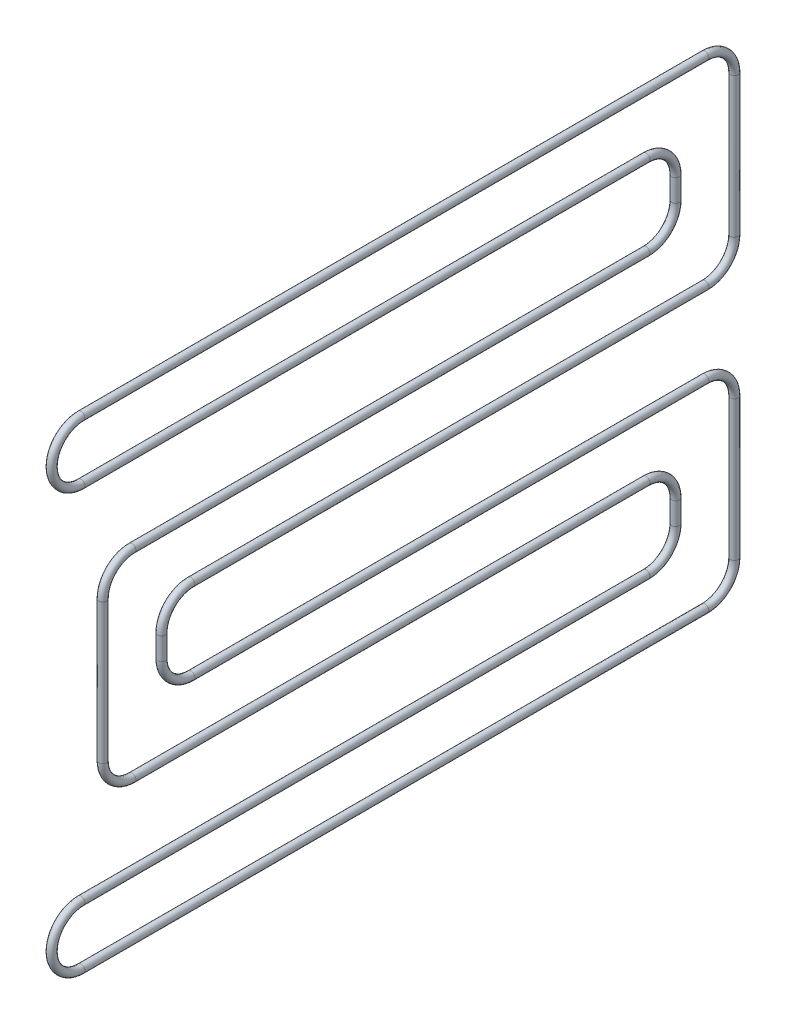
ISO-10303-21;
HEADER;
FILE_DESCRIPTION(('STEP AP214'),'2;1');
FILE_NAME('part.step','',(''),(''),'','','');
FILE_SCHEMA(('AUTOMOTIVE_DESIGN { 1 0 10303 214 1 1 1 1 }'));
ENDSEC;
DATA;
#1=APPLICATION_CONTEXT('core data for automotive mechanical design processes');
#2=APPLICATION_PROTOCOL_DEFINITION('international standard','automotive_design',2000,#1);
#3=PRODUCT_CONTEXT('',#1,'mechanical');
#4=PRODUCT('Part','Part','',(#3));
#5=PRODUCT_RELATED_PRODUCT_CATEGORY('part','',(#4));
#6=PRODUCT_DEFINITION_FORMATION('','',#4);
#7=PRODUCT_DEFINITION_CONTEXT('part definition',#1,'design');
#8=PRODUCT_DEFINITION('design','',#6,#7);
#9=PRODUCT_DEFINITION_SHAPE('','',#8);
#10=(LENGTH_UNIT() NAMED_UNIT(*) SI_UNIT(.MILLI.,.METRE.));
#11=(NAMED_UNIT(*) PLANE_ANGLE_UNIT() SI_UNIT($,.RADIAN.));
#12=(NAMED_UNIT(*) SI_UNIT($,.STERADIAN.) SOLID_ANGLE_UNIT());
#13=UNCERTAINTY_MEASURE_WITH_UNIT(LENGTH_MEASURE(1.E-05),#10,'distance_accuracy_value','');
#14=(GEOMETRIC_REPRESENTATION_CONTEXT(3) GLOBAL_UNCERTAINTY_ASSIGNED_CONTEXT((#13)) GLOBAL_UNIT_ASSIGNED_CONTEXT((#10,
#11,#12)) REPRESENTATION_CONTEXT('',''));
#15=CARTESIAN_POINT('',(0.,0.,0.));
#16=DIRECTION('',(0.,0.,1.));
#17=DIRECTION('',(1.,0.,0.));
#18=AXIS2_PLACEMENT_3D('',#15,#16,#17);
#19=CARTESIAN_POINT('',(0.,0.,318.));
#20=DIRECTION('',(0.,0.,-1.));
#21=DIRECTION('',(0.,1.,0.));
#22=AXIS2_PLACEMENT_3D('',#19,#20,#21);
#23=CYLINDRICAL_SURFACE('',#22,2.);
#24=CARTESIAN_POINT('',(0.,0.,318.));
#25=DIRECTION('',(0.,0.,1.));
#26=DIRECTION('',(1.,0.,0.));
#27=AXIS2_PLACEMENT_3D('',#24,#25,#26);
#28=CIRCLE('',#27,2.);
#29=CARTESIAN_POINT('',(0.,2.00000000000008,318.));
#30=VERTEX_POINT('',#29);
#31=EDGE_CURVE('E46',#30,#30,#28,.T.);
#32=ORIENTED_EDGE('',*,*,#31,.F.);
#33=EDGE_LOOP('',(#32));
#34=FACE_BOUND('',#33,.T.);
#35=CARTESIAN_POINT('',(0.,0.,2.22044604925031E-13));
#36=DIRECTION('',(0.,0.,1.));
#37=DIRECTION('',(1.,0.,0.));
#38=AXIS2_PLACEMENT_3D('',#35,#36,#37);
#39=CIRCLE('',#38,2.);
#40=CARTESIAN_POINT('',(2.,0.,1.11022302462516E-13));
#41=VERTEX_POINT('',#40);
#42=EDGE_CURVE('E10',#41,#41,#39,.T.);
#43=ORIENTED_EDGE('',*,*,#42,.T.);
#44=EDGE_LOOP('',(#43));
#45=FACE_BOUND('',#44,.T.);
#46=ADVANCED_FACE('F35',(#34,#45),#23,.T.);
#47=CARTESIAN_POINT('',(0.,-15.,318.));
#48=DIRECTION('',(-1.,0.,0.));
#49=DIRECTION('',(0.,0.,1.));
#50=AXIS2_PLACEMENT_3D('',#47,#48,#49);
#51=TOROIDAL_SURFACE('',#50,15.,2.);
#52=CARTESIAN_POINT('',(0.,-30.,318.));
#53=DIRECTION('',(0.,0.,-1.));
#54=DIRECTION('',(1.,0.,0.));
#55=AXIS2_PLACEMENT_3D('',#52,#53,#54);
#56=CIRCLE('',#55,2.);
#57=CARTESIAN_POINT('',(0.,-32.,318.));
#58=VERTEX_POINT('',#57);
#59=EDGE_CURVE('E53',#58,#58,#56,.T.);
#60=CARTESIAN_POINT('',(0.,-15.,318.));
#61=DIRECTION('',(-1.,0.,0.));
#62=DIRECTION('',(0.,0.,1.));
#63=AXIS2_PLACEMENT_3D('',#60,#61,#62);
#64=CIRCLE('',#63,17.);
#65=EDGE_CURVE('',#58,#30,#64,.T.);
#66=ORIENTED_EDGE('',*,*,#59,.F.);
#67=ORIENTED_EDGE('',*,*,#31,.T.);
#68=ORIENTED_EDGE('',*,*,#65,.T.);
#69=ORIENTED_EDGE('',*,*,#65,.F.);
#70=EDGE_LOOP('',(#66,#68,#67,#69));
#71=FACE_BOUND('',#70,.T.);
#72=ADVANCED_FACE('F83',(#71),#51,.T.);
#73=CARTESIAN_POINT('',(0.,-30.0000000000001,30.0000000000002));
#74=DIRECTION('',(0.,0.,1.));
#75=DIRECTION('',(0.,-1.,0.));
#76=AXIS2_PLACEMENT_3D('',#73,#74,#75);
#77=CYLINDRICAL_SURFACE('',#76,2.);
#78=CARTESIAN_POINT('',(0.,-30.0000000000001,30.0000000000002));
#79=DIRECTION('',(0.,0.,-1.));
#80=DIRECTION('',(1.,0.,0.));
#81=AXIS2_PLACEMENT_3D('',#78,#79,#80);
#82=CIRCLE('',#81,2.);
#83=CARTESIAN_POINT('',(0.,-28.0000000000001,30.0000000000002));
#84=VERTEX_POINT('',#83);
#85=EDGE_CURVE('E58',#84,#84,#82,.T.);
#86=ORIENTED_EDGE('',*,*,#85,.F.);
#87=EDGE_LOOP('',(#86));
#88=FACE_BOUND('',#87,.T.);
#89=ORIENTED_EDGE('',*,*,#59,.T.);
#90=EDGE_LOOP('',(#89));
#91=FACE_BOUND('',#90,.T.);
#92=ADVANCED_FACE('F88',(#88,#91),#77,.T.);
#93=CARTESIAN_POINT('',(0.,-45.,30.0000000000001));
#94=DIRECTION('',(1.,0.,0.));
#95=DIRECTION('',(0.,0.,-1.));
#96=AXIS2_PLACEMENT_3D('',#93,#94,#95);
#97=TOROIDAL_SURFACE('',#96,14.9999999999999,2.);
#98=CARTESIAN_POINT('',(0.,-45.,15.0000000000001));
#99=DIRECTION('',(0.,-1.,0.));
#100=DIRECTION('',(1.,0.,0.));
#101=AXIS2_PLACEMENT_3D('',#98,#99,#100);
#102=CIRCLE('',#101,2.);
#103=CARTESIAN_POINT('',(0.,-45.,13.0000000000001));
#104=VERTEX_POINT('',#103);
#105=EDGE_CURVE('E283',#104,#104,#102,.T.);
#106=CARTESIAN_POINT('',(0.,-45.,30.0000000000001));
#107=DIRECTION('',(1.,0.,0.));
#108=DIRECTION('',(0.,0.,-1.));
#109=AXIS2_PLACEMENT_3D('',#106,#107,#108);
#110=CIRCLE('',#109,16.9999999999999);
#111=EDGE_CURVE('',#104,#84,#110,.T.);
#112=ORIENTED_EDGE('',*,*,#105,.F.);
#113=ORIENTED_EDGE('',*,*,#85,.T.);
#114=ORIENTED_EDGE('',*,*,#111,.T.);
#115=ORIENTED_EDGE('',*,*,#111,.F.);
#116=EDGE_LOOP('',(#112,#114,#113,#115));
#117=FACE_BOUND('',#116,.T.);
#118=ADVANCED_FACE('F93',(#117),#97,.T.);
#119=CARTESIAN_POINT('',(0.,-56.3332999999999,15.0000000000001));
#120=DIRECTION('',(0.,1.,0.));
#121=DIRECTION('',(0.,0.,1.));
#122=AXIS2_PLACEMENT_3D('',#119,#120,#121);
#123=CYLINDRICAL_SURFACE('',#122,2.);
#124=CARTESIAN_POINT('',(0.,-56.3332999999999,15.0000000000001));
#125=DIRECTION('',(0.,-1.,0.));
#126=DIRECTION('',(1.,0.,0.));
#127=AXIS2_PLACEMENT_3D('',#124,#125,#126);
#128=CIRCLE('',#127,2.);
#129=CARTESIAN_POINT('',(0.,-56.3332999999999,13.0000000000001));
#130=VERTEX_POINT('',#129);
#131=EDGE_CURVE('E279',#130,#130,#128,.T.);
#132=ORIENTED_EDGE('',*,*,#131,.F.);
#133=EDGE_LOOP('',(#132));
#134=FACE_BOUND('',#133,.T.);
#135=ORIENTED_EDGE('',*,*,#105,.T.);
#136=EDGE_LOOP('',(#135));
#137=FACE_BOUND('',#136,.T.);
#138=ADVANCED_FACE('F100',(#134,#137),#123,.T.);
#139=CARTESIAN_POINT('',(0.,-56.3333,30.0000000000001));
#140=DIRECTION('',(1.,0.,0.));
#141=DIRECTION('',(0.,0.,-1.));
#142=AXIS2_PLACEMENT_3D('',#139,#140,#141);
#143=TOROIDAL_SURFACE('',#142,15.,2.);
#144=CARTESIAN_POINT('',(0.,-71.3332999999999,30.));
#145=DIRECTION('',(0.,0.,1.));
#146=DIRECTION('',(1.,0.,0.));
#147=AXIS2_PLACEMENT_3D('',#144,#145,#146);
#148=CIRCLE('',#147,2.);
#149=CARTESIAN_POINT('',(0.,-73.3332999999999,30.));
#150=VERTEX_POINT('',#149);
#151=EDGE_CURVE('E275',#150,#150,#148,.T.);
#152=CARTESIAN_POINT('',(0.,-56.3333,30.0000000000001));
#153=DIRECTION('',(1.,0.,0.));
#154=DIRECTION('',(0.,0.,-1.));
#155=AXIS2_PLACEMENT_3D('',#152,#153,#154);
#156=CIRCLE('',#155,17.);
#157=EDGE_CURVE('',#150,#130,#156,.T.);
#158=ORIENTED_EDGE('',*,*,#151,.F.);
#159=ORIENTED_EDGE('',*,*,#131,.T.);
#160=ORIENTED_EDGE('',*,*,#157,.T.);
#161=ORIENTED_EDGE('',*,*,#157,.F.);
#162=EDGE_LOOP('',(#158,#160,#159,#161));
#163=FACE_BOUND('',#162,.T.);
#164=ADVANCED_FACE('F104',(#163),#143,.T.);
#165=CARTESIAN_POINT('',(0.,-71.3332999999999,292.));
#166=DIRECTION('',(0.,0.,-1.));
#167=DIRECTION('',(-1.,0.,0.));
#168=AXIS2_PLACEMENT_3D('',#165,#166,#167);
#169=CYLINDRICAL_SURFACE('',#168,2.);
#170=CARTESIAN_POINT('',(0.,-71.3332999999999,292.));
#171=DIRECTION('',(0.,0.,1.));
#172=DIRECTION('',(1.,0.,0.));
#173=AXIS2_PLACEMENT_3D('',#170,#171,#172);
#174=CIRCLE('',#173,2.);
#175=CARTESIAN_POINT('',(0.,-69.3333,292.));
#176=VERTEX_POINT('',#175);
#177=EDGE_CURVE('E271',#176,#176,#174,.T.);
#178=ORIENTED_EDGE('',*,*,#177,.F.);
#179=EDGE_LOOP('',(#178));
#180=FACE_BOUND('',#179,.T.);
#181=ORIENTED_EDGE('',*,*,#151,.T.);
#182=EDGE_LOOP('',(#181));
#183=FACE_BOUND('',#182,.T.);
#184=ADVANCED_FACE('F108',(#180,#183),#169,.T.);
#185=CARTESIAN_POINT('',(0.,-86.3333,292.));
#186=DIRECTION('',(-1.,0.,0.));
#187=DIRECTION('',(0.,0.,1.));
#188=AXIS2_PLACEMENT_3D('',#185,#186,#187);
#189=TOROIDAL_SURFACE('',#188,15.,2.);
#190=CARTESIAN_POINT('',(0.,-86.3333,307.));
#191=DIRECTION('',(0.,-1.,0.));
#192=DIRECTION('',(1.,0.,0.));
#193=AXIS2_PLACEMENT_3D('',#190,#191,#192);
#194=CIRCLE('',#193,2.);
#195=CARTESIAN_POINT('',(0.,-86.3333,309.));
#196=VERTEX_POINT('',#195);
#197=EDGE_CURVE('E267',#196,#196,#194,.T.);
#198=CARTESIAN_POINT('',(0.,-86.3333,292.));
#199=DIRECTION('',(-1.,0.,0.));
#200=DIRECTION('',(0.,0.,1.));
#201=AXIS2_PLACEMENT_3D('',#198,#199,#200);
#202=CIRCLE('',#201,17.);
#203=EDGE_CURVE('',#196,#176,#202,.T.);
#204=ORIENTED_EDGE('',*,*,#197,.F.);
#205=ORIENTED_EDGE('',*,*,#177,.T.);
#206=ORIENTED_EDGE('',*,*,#203,.T.);
#207=ORIENTED_EDGE('',*,*,#203,.F.);
#208=EDGE_LOOP('',(#204,#206,#205,#207));
#209=FACE_BOUND('',#208,.T.);
#210=ADVANCED_FACE('F112',(#209),#189,.T.);
#211=CARTESIAN_POINT('',(0.,-157.6666,307.));
#212=DIRECTION('',(0.,1.,0.));
#213=DIRECTION('',(0.,0.,1.));
#214=AXIS2_PLACEMENT_3D('',#211,#212,#213);
#215=CYLINDRICAL_SURFACE('',#214,2.);
#216=CARTESIAN_POINT('',(0.,-157.6666,307.));
#217=DIRECTION('',(0.,-1.,0.));
#218=DIRECTION('',(1.,0.,0.));
#219=AXIS2_PLACEMENT_3D('',#216,#217,#218);
#220=CIRCLE('',#219,2.);
#221=CARTESIAN_POINT('',(0.,-157.6666,309.));
#222=VERTEX_POINT('',#221);
#223=EDGE_CURVE('E263',#222,#222,#220,.T.);
#224=CARTESIAN_POINT('',(0.,-157.6666,309.));
#225=CARTESIAN_POINT('',(0.,-156.923544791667,309.));
#226=CARTESIAN_POINT('',(0.,-156.180489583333,309.));
#227=CARTESIAN_POINT('',(0.,-154.694379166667,309.));
#228=CARTESIAN_POINT('',(0.,-153.951323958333,309.));
#229=CARTESIAN_POINT('',(0.,-152.465213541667,309.));
#230=CARTESIAN_POINT('',(0.,-151.722158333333,309.));
#231=CARTESIAN_POINT('',(0.,-150.236047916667,309.));
#232=CARTESIAN_POINT('',(0.,-149.492992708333,309.));
#233=CARTESIAN_POINT('',(0.,-148.006882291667,309.));
#234=CARTESIAN_POINT('',(0.,-147.263827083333,309.));
#235=CARTESIAN_POINT('',(0.,-145.777716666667,309.));
#236=CARTESIAN_POINT('',(0.,-145.034661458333,309.));
#237=CARTESIAN_POINT('',(0.,-143.548551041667,309.));
#238=CARTESIAN_POINT('',(0.,-142.805495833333,309.));
#239=CARTESIAN_POINT('',(0.,-141.319385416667,309.));
#240=CARTESIAN_POINT('',(0.,-140.576330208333,309.));
#241=CARTESIAN_POINT('',(0.,-139.090219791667,309.));
#242=CARTESIAN_POINT('',(0.,-138.347164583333,309.));
#243=CARTESIAN_POINT('',(0.,-136.861054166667,309.));
#244=CARTESIAN_POINT('',(0.,-136.117998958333,309.));
#245=CARTESIAN_POINT('',(0.,-134.631888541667,309.));
#246=CARTESIAN_POINT('',(0.,-133.888833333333,309.));
#247=CARTESIAN_POINT('',(0.,-132.402722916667,309.));
#248=CARTESIAN_POINT('',(0.,-131.659667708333,309.));
#249=CARTESIAN_POINT('',(0.,-130.173557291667,309.));
#250=CARTESIAN_POINT('',(0.,-129.430502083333,309.));
#251=CARTESIAN_POINT('',(0.,-127.944391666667,309.));
#252=CARTESIAN_POINT('',(0.,-127.201336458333,309.));
#253=CARTESIAN_POINT('',(0.,-125.715226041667,309.));
#254=CARTESIAN_POINT('',(0.,-124.972170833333,309.));
#255=CARTESIAN_POINT('',(0.,-123.486060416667,309.));
#256=CARTESIAN_POINT('',(0.,-122.743005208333,309.));
#257=CARTESIAN_POINT('',(0.,-121.256894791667,309.));
#258=CARTESIAN_POINT('',(0.,-120.513839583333,309.));
#259=CARTESIAN_POINT('',(0.,-119.027729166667,309.));
#260=CARTESIAN_POINT('',(0.,-118.284673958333,309.));
#261=CARTESIAN_POINT('',(0.,-116.798563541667,309.));
#262=CARTESIAN_POINT('',(0.,-116.055508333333,309.));
#263=CARTESIAN_POINT('',(0.,-114.569397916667,309.));
#264=CARTESIAN_POINT('',(0.,-113.826342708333,309.));
#265=CARTESIAN_POINT('',(0.,-112.340232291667,309.));
#266=CARTESIAN_POINT('',(0.,-111.597177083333,309.));
#267=CARTESIAN_POINT('',(0.,-110.111066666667,309.));
#268=CARTESIAN_POINT('',(0.,-109.368011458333,309.));
#269=CARTESIAN_POINT('',(0.,-107.881901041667,309.));
#270=CARTESIAN_POINT('',(0.,-107.138845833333,309.));
#271=CARTESIAN_POINT('',(0.,-105.652735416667,309.));
#272=CARTESIAN_POINT('',(0.,-104.909680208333,309.));
#273=CARTESIAN_POINT('',(0.,-103.423569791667,309.));
#274=CARTESIAN_POINT('',(0.,-102.680514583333,309.));
#275=CARTESIAN_POINT('',(0.,-101.194404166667,309.));
#276=CARTESIAN_POINT('',(0.,-100.451348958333,309.));
#277=CARTESIAN_POINT('',(0.,-98.9652385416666,309.));
#278=CARTESIAN_POINT('',(0.,-98.2221833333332,309.));
#279=CARTESIAN_POINT('',(0.,-96.7360729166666,309.));
#280=CARTESIAN_POINT('',(0.,-95.9930177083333,309.));
#281=CARTESIAN_POINT('',(0.,-94.5069072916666,309.));
#282=CARTESIAN_POINT('',(0.,-93.7638520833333,309.));
#283=CARTESIAN_POINT('',(0.,-92.2777416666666,309.));
#284=CARTESIAN_POINT('',(0.,-91.5346864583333,309.));
#285=CARTESIAN_POINT('',(0.,-90.0485760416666,309.));
#286=CARTESIAN_POINT('',(0.,-89.3055208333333,309.));
#287=CARTESIAN_POINT('',(0.,-87.8194104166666,309.));
#288=CARTESIAN_POINT('',(0.,-87.0763552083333,309.));
#289=CARTESIAN_POINT('',(0.,-86.3332999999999,309.));
#290=B_SPLINE_CURVE_WITH_KNOTS('',3,(#224,#225,#226,#227,#228,#229,#230,#231,#232,#233,#234,
#235,#236,#237,#238,#239,#240,#241,#242,#243,#244,#245,#246,#247,#248,#249,#250,#251,#252,#253,
#254,#255,#256,#257,#258,#259,#260,#261,#262,#263,#264,#265,#266,#267,#268,#269,#270,#271,#272,
#273,#274,#275,#276,#277,#278,#279,#280,#281,#282,#283,#284,#285,#286,#287,#288,#289),
.UNSPECIFIED.,.F.,.F.,(4,2,2,2,2,2,2,2,2,2,2,2,2,2,2,2,2,2,2,2,2,2,2,2,2,2,2,2,2,2,2,2,4),(0.,
2.22916562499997,4.45833124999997,6.68749687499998,8.91666249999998,11.145828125,13.37499375,
15.604159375,17.833325,20.062490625,22.29165625,24.520821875,26.7499875,28.979153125,
31.20831875,33.437484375,35.66665,37.895815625,40.12498125,42.354146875,44.5833125,46.812478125,
49.04164375,51.270809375,53.4999749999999,55.7291406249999,57.9583062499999,60.187471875,
62.4166375,64.6458031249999,66.87496875,69.1041343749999,71.3333),.UNSPECIFIED.);
#291=EDGE_CURVE('BSEAM116',#222,#196,#290,.T.);
#292=ORIENTED_EDGE('',*,*,#223,.F.);
#293=ORIENTED_EDGE('',*,*,#197,.T.);
#294=ORIENTED_EDGE('',*,*,#291,.T.);
#295=ORIENTED_EDGE('',*,*,#291,.F.);
#296=EDGE_LOOP('',(#292,#294,#293,#295));
#297=FACE_BOUND('',#296,.T.);
#298=ADVANCED_FACE('F116',(#297),#215,.T.);
#299=CARTESIAN_POINT('',(0.,-157.6666,292.));
#300=DIRECTION('',(-1.,0.,0.));
#301=DIRECTION('',(0.,0.,1.));
#302=AXIS2_PLACEMENT_3D('',#299,#300,#301);
#303=TOROIDAL_SURFACE('',#302,15.,2.);
#304=CARTESIAN_POINT('',(0.,-172.6666,292.));
#305=DIRECTION('',(0.,0.,-1.));
#306=DIRECTION('',(1.,0.,0.));
#307=AXIS2_PLACEMENT_3D('',#304,#305,#306);
#308=CIRCLE('',#307,2.);
#309=CARTESIAN_POINT('',(0.,-174.6666,292.));
#310=VERTEX_POINT('',#309);
#311=EDGE_CURVE('E259',#310,#310,#308,.T.);
#312=CARTESIAN_POINT('',(0.,-157.6666,292.));
#313=DIRECTION('',(-1.,0.,0.));
#314=DIRECTION('',(0.,0.,1.));
#315=AXIS2_PLACEMENT_3D('',#312,#313,#314);
#316=CIRCLE('',#315,17.);
#317=EDGE_CURVE('',#310,#222,#316,.T.);
#318=ORIENTED_EDGE('',*,*,#311,.F.);
#319=ORIENTED_EDGE('',*,*,#223,.T.);
#320=ORIENTED_EDGE('',*,*,#317,.T.);
#321=ORIENTED_EDGE('',*,*,#317,.F.);
#322=EDGE_LOOP('',(#318,#320,#319,#321));
#323=FACE_BOUND('',#322,.T.);
#324=ADVANCED_FACE('F120',(#323),#303,.T.);
#325=CARTESIAN_POINT('',(0.,-172.6666,30.0000000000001));
#326=DIRECTION('',(0.,0.,1.));
#327=DIRECTION('',(0.,-1.,0.));
#328=AXIS2_PLACEMENT_3D('',#325,#326,#327);
#329=CYLINDRICAL_SURFACE('',#328,2.);
#330=CARTESIAN_POINT('',(0.,-172.6666,30.0000000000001));
#331=DIRECTION('',(0.,0.,-1.));
#332=DIRECTION('',(1.,0.,0.));
#333=AXIS2_PLACEMENT_3D('',#330,#331,#332);
#334=CIRCLE('',#333,2.);
#335=CARTESIAN_POINT('',(0.,-170.6666,30.0000000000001));
#336=VERTEX_POINT('',#335);
#337=EDGE_CURVE('E255',#336,#336,#334,.T.);
#338=ORIENTED_EDGE('',*,*,#337,.F.);
#339=EDGE_LOOP('',(#338));
#340=FACE_BOUND('',#339,.T.);
#341=ORIENTED_EDGE('',*,*,#311,.T.);
#342=EDGE_LOOP('',(#341));
#343=FACE_BOUND('',#342,.T.);
#344=ADVANCED_FACE('F124',(#340,#343),#329,.T.);
#345=CARTESIAN_POINT('',(0.,-187.6666,30.0000000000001));
#346=DIRECTION('',(1.,0.,0.));
#347=DIRECTION('',(0.,0.,-1.));
#348=AXIS2_PLACEMENT_3D('',#345,#346,#347);
#349=TOROIDAL_SURFACE('',#348,15.,2.);
#350=CARTESIAN_POINT('',(0.,-187.6666,15.0000000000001));
#351=DIRECTION('',(0.,-1.,0.));
#352=DIRECTION('',(1.,0.,0.));
#353=AXIS2_PLACEMENT_3D('',#350,#351,#352);
#354=CIRCLE('',#353,2.);
#355=CARTESIAN_POINT('',(0.,-187.6666,13.0000000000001));
#356=VERTEX_POINT('',#355);
#357=EDGE_CURVE('E251',#356,#356,#354,.T.);
#358=CARTESIAN_POINT('',(0.,-187.6666,30.0000000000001));
#359=DIRECTION('',(1.,0.,0.));
#360=DIRECTION('',(0.,0.,-1.));
#361=AXIS2_PLACEMENT_3D('',#358,#359,#360);
#362=CIRCLE('',#361,17.);
#363=EDGE_CURVE('',#356,#336,#362,.T.);
#364=ORIENTED_EDGE('',*,*,#357,.F.);
#365=ORIENTED_EDGE('',*,*,#337,.T.);
#366=ORIENTED_EDGE('',*,*,#363,.T.);
#367=ORIENTED_EDGE('',*,*,#363,.F.);
#368=EDGE_LOOP('',(#364,#366,#365,#367));
#369=FACE_BOUND('',#368,.T.);
#370=ADVANCED_FACE('F128',(#369),#349,.T.);
#371=CARTESIAN_POINT('',(0.,-198.9999,15.0000000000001));
#372=DIRECTION('',(0.,1.,0.));
#373=DIRECTION('',(0.,0.,1.));
#374=AXIS2_PLACEMENT_3D('',#371,#372,#373);
#375=CYLINDRICAL_SURFACE('',#374,2.);
#376=CARTESIAN_POINT('',(0.,-198.9999,15.0000000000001));
#377=DIRECTION('',(0.,-1.,0.));
#378=DIRECTION('',(1.,0.,0.));
#379=AXIS2_PLACEMENT_3D('',#376,#377,#378);
#380=CIRCLE('',#379,2.);
#381=CARTESIAN_POINT('',(0.,-198.9999,13.0000000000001));
#382=VERTEX_POINT('',#381);
#383=EDGE_CURVE('E247',#382,#382,#380,.T.);
#384=ORIENTED_EDGE('',*,*,#383,.F.);
#385=EDGE_LOOP('',(#384));
#386=FACE_BOUND('',#385,.T.);
#387=ORIENTED_EDGE('',*,*,#357,.T.);
#388=EDGE_LOOP('',(#387));
#389=FACE_BOUND('',#388,.T.);
#390=ADVANCED_FACE('F132',(#386,#389),#375,.T.);
#391=CARTESIAN_POINT('',(0.,-198.9999,30.0000000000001));
#392=DIRECTION('',(1.,0.,0.));
#393=DIRECTION('',(0.,0.,-1.));
#394=AXIS2_PLACEMENT_3D('',#391,#392,#393);
#395=TOROIDAL_SURFACE('',#394,15.,2.);
#396=CARTESIAN_POINT('',(0.,-213.9999,30.));
#397=DIRECTION('',(0.,0.,1.));
#398=DIRECTION('',(1.,0.,0.));
#399=AXIS2_PLACEMENT_3D('',#396,#397,#398);
#400=CIRCLE('',#399,2.);
#401=CARTESIAN_POINT('',(0.,-215.9999,30.));
#402=VERTEX_POINT('',#401);
#403=EDGE_CURVE('E243',#402,#402,#400,.T.);
#404=CARTESIAN_POINT('',(0.,-198.9999,30.0000000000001));
#405=DIRECTION('',(1.,0.,0.));
#406=DIRECTION('',(0.,0.,-1.));
#407=AXIS2_PLACEMENT_3D('',#404,#405,#406);
#408=CIRCLE('',#407,17.);
#409=EDGE_CURVE('',#402,#382,#408,.T.);
#410=ORIENTED_EDGE('',*,*,#403,.F.);
#411=ORIENTED_EDGE('',*,*,#383,.T.);
#412=ORIENTED_EDGE('',*,*,#409,.T.);
#413=ORIENTED_EDGE('',*,*,#409,.F.);
#414=EDGE_LOOP('',(#410,#412,#411,#413));
#415=FACE_BOUND('',#414,.T.);
#416=ADVANCED_FACE('F136',(#415),#395,.T.);
#417=CARTESIAN_POINT('',(0.,-213.9999,318.));
#418=DIRECTION('',(0.,0.,-1.));
#419=DIRECTION('',(-1.,0.,0.));
#420=AXIS2_PLACEMENT_3D('',#417,#418,#419);
#421=CYLINDRICAL_SURFACE('',#420,2.);
#422=CARTESIAN_POINT('',(0.,-213.9999,318.));
#423=DIRECTION('',(0.,0.,1.));
#424=DIRECTION('',(1.,0.,0.));
#425=AXIS2_PLACEMENT_3D('',#422,#423,#424);
#426=CIRCLE('',#425,2.);
#427=CARTESIAN_POINT('',(0.,-211.9999,318.));
#428=VERTEX_POINT('',#427);
#429=EDGE_CURVE('E239',#428,#428,#426,.T.);
#430=ORIENTED_EDGE('',*,*,#429,.F.);
#431=EDGE_LOOP('',(#430));
#432=FACE_BOUND('',#431,.T.);
#433=ORIENTED_EDGE('',*,*,#403,.T.);
#434=EDGE_LOOP('',(#433));
#435=FACE_BOUND('',#434,.T.);
#436=ADVANCED_FACE('F140',(#432,#435),#421,.T.);
#437=CARTESIAN_POINT('',(0.,-228.9999,318.));
#438=DIRECTION('',(-1.,0.,0.));
#439=DIRECTION('',(0.,0.,1.));
#440=AXIS2_PLACEMENT_3D('',#437,#438,#439);
#441=TOROIDAL_SURFACE('',#440,15.,2.);
#442=CARTESIAN_POINT('',(0.,-243.9999,318.));
#443=DIRECTION('',(0.,0.,-1.));
#444=DIRECTION('',(1.,0.,0.));
#445=AXIS2_PLACEMENT_3D('',#442,#443,#444);
#446=CIRCLE('',#445,2.);
#447=CARTESIAN_POINT('',(0.,-245.9999,318.));
#448=VERTEX_POINT('',#447);
#449=EDGE_CURVE('E235',#448,#448,#446,.T.);
#450=CARTESIAN_POINT('',(0.,-228.9999,318.));
#451=DIRECTION('',(-1.,0.,0.));
#452=DIRECTION('',(0.,0.,1.));
#453=AXIS2_PLACEMENT_3D('',#450,#451,#452);
#454=CIRCLE('',#453,17.);
#455=EDGE_CURVE('',#448,#428,#454,.T.);
#456=ORIENTED_EDGE('',*,*,#449,.F.);
#457=ORIENTED_EDGE('',*,*,#429,.T.);
#458=ORIENTED_EDGE('',*,*,#455,.T.);
#459=ORIENTED_EDGE('',*,*,#455,.F.);
#460=EDGE_LOOP('',(#456,#458,#457,#459));
#461=FACE_BOUND('',#460,.T.);
#462=ADVANCED_FACE('F144',(#461),#441,.T.);
#463=CARTESIAN_POINT('',(0.,-243.9999,2.4980018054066E-13));
#464=DIRECTION('',(0.,0.,1.));
#465=DIRECTION('',(0.,-1.,0.));
#466=AXIS2_PLACEMENT_3D('',#463,#464,#465);
#467=CYLINDRICAL_SURFACE('',#466,2.);
#468=CARTESIAN_POINT('',(0.,-243.9999,2.4980018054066E-13));
#469=DIRECTION('',(0.,0.,-1.));
#470=DIRECTION('',(1.,0.,0.));
#471=AXIS2_PLACEMENT_3D('',#468,#469,#470);
#472=CIRCLE('',#471,2.);
#473=CARTESIAN_POINT('',(0.,-245.9999,2.7570538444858E-13));
#474=VERTEX_POINT('',#473);
#475=EDGE_CURVE('E231',#474,#474,#472,.T.);
#476=ORIENTED_EDGE('',*,*,#475,.F.);
#477=EDGE_LOOP('',(#476));
#478=FACE_BOUND('',#477,.T.);
#479=ORIENTED_EDGE('',*,*,#449,.T.);
#480=EDGE_LOOP('',(#479));
#481=FACE_BOUND('',#480,.T.);
#482=ADVANCED_FACE('F148',(#478,#481),#467,.T.);
#483=CARTESIAN_POINT('',(0.,-228.9999,0.));
#484=DIRECTION('',(-1.,0.,0.));
#485=DIRECTION('',(0.,0.,1.));
#486=AXIS2_PLACEMENT_3D('',#483,#484,#485);
#487=TOROIDAL_SURFACE('',#486,15.,2.);
#488=CARTESIAN_POINT('',(0.,-228.9999,-15.));
#489=DIRECTION('',(0.,1.,0.));
#490=DIRECTION('',(1.,0.,0.));
#491=AXIS2_PLACEMENT_3D('',#488,#489,#490);
#492=CIRCLE('',#491,2.);
#493=CARTESIAN_POINT('',(0.,-228.9999,-17.));
#494=VERTEX_POINT('',#493);
#495=EDGE_CURVE('E227',#494,#494,#492,.T.);
#496=CARTESIAN_POINT('',(0.,-228.9999,0.));
#497=DIRECTION('',(-1.,0.,0.));
#498=DIRECTION('',(0.,0.,1.));
#499=AXIS2_PLACEMENT_3D('',#496,#497,#498);
#500=CIRCLE('',#499,17.);
#501=EDGE_CURVE('',#494,#474,#500,.T.);
#502=ORIENTED_EDGE('',*,*,#495,.F.);
#503=ORIENTED_EDGE('',*,*,#475,.T.);
#504=ORIENTED_EDGE('',*,*,#501,.T.);
#505=ORIENTED_EDGE('',*,*,#501,.F.);
#506=EDGE_LOOP('',(#502,#504,#503,#505));
#507=FACE_BOUND('',#506,.T.);
#508=ADVANCED_FACE('F152',(#507),#487,.T.);
#509=CARTESIAN_POINT('',(0.,-157.6666,-15.));
#510=DIRECTION('',(0.,-1.,0.));
#511=DIRECTION('',(0.,0.,-1.));
#512=AXIS2_PLACEMENT_3D('',#509,#510,#511);
#513=CYLINDRICAL_SURFACE('',#512,2.);
#514=CARTESIAN_POINT('',(0.,-157.6666,-15.));
#515=DIRECTION('',(0.,1.,0.));
#516=DIRECTION('',(1.,0.,0.));
#517=AXIS2_PLACEMENT_3D('',#514,#515,#516);
#518=CIRCLE('',#517,2.);
#519=CARTESIAN_POINT('',(0.,-157.6666,-17.));
#520=VERTEX_POINT('',#519);
#521=EDGE_CURVE('E223',#520,#520,#518,.T.);
#522=ORIENTED_EDGE('',*,*,#521,.F.);
#523=EDGE_LOOP('',(#522));
#524=FACE_BOUND('',#523,.T.);
#525=ORIENTED_EDGE('',*,*,#495,.T.);
#526=EDGE_LOOP('',(#525));
#527=FACE_BOUND('',#526,.T.);
#528=ADVANCED_FACE('F156',(#524,#527),#513,.T.);
#529=CARTESIAN_POINT('',(0.,-157.6666,0.));
#530=DIRECTION('',(-1.,0.,0.));
#531=DIRECTION('',(0.,0.,1.));
#532=AXIS2_PLACEMENT_3D('',#529,#530,#531);
#533=TOROIDAL_SURFACE('',#532,15.,2.);
#534=CARTESIAN_POINT('',(0.,-142.6666,0.));
#535=DIRECTION('',(0.,0.,1.));
#536=DIRECTION('',(1.,0.,0.));
#537=AXIS2_PLACEMENT_3D('',#534,#535,#536);
#538=CIRCLE('',#537,2.);
#539=CARTESIAN_POINT('',(0.,-140.6666,0.));
#540=VERTEX_POINT('',#539);
#541=EDGE_CURVE('E219',#540,#540,#538,.T.);
#542=CARTESIAN_POINT('',(0.,-157.6666,0.));
#543=DIRECTION('',(-1.,0.,0.));
#544=DIRECTION('',(0.,0.,1.));
#545=AXIS2_PLACEMENT_3D('',#542,#543,#544);
#546=CIRCLE('',#545,17.);
#547=EDGE_CURVE('',#540,#520,#546,.T.);
#548=ORIENTED_EDGE('',*,*,#541,.F.);
#549=ORIENTED_EDGE('',*,*,#521,.T.);
#550=ORIENTED_EDGE('',*,*,#547,.T.);
#551=ORIENTED_EDGE('',*,*,#547,.F.);
#552=EDGE_LOOP('',(#548,#550,#549,#551));
#553=FACE_BOUND('',#552,.T.);
#554=ADVANCED_FACE('F160',(#553),#533,.T.);
#555=CARTESIAN_POINT('',(0.,-142.6666,262.));
#556=DIRECTION('',(0.,0.,-1.));
#557=DIRECTION('',(0.,1.,0.));
#558=AXIS2_PLACEMENT_3D('',#555,#556,#557);
#559=CYLINDRICAL_SURFACE('',#558,2.);
#560=CARTESIAN_POINT('',(0.,-142.6666,262.));
#561=DIRECTION('',(0.,0.,1.));
#562=DIRECTION('',(1.,0.,0.));
#563=AXIS2_PLACEMENT_3D('',#560,#561,#562);
#564=CIRCLE('',#563,2.);
#565=CARTESIAN_POINT('',(0.,-144.6666,262.));
#566=VERTEX_POINT('',#565);
#567=EDGE_CURVE('E215',#566,#566,#564,.T.);
#568=ORIENTED_EDGE('',*,*,#567,.F.);
#569=EDGE_LOOP('',(#568));
#570=FACE_BOUND('',#569,.T.);
#571=ORIENTED_EDGE('',*,*,#541,.T.);
#572=EDGE_LOOP('',(#571));
#573=FACE_BOUND('',#572,.T.);
#574=ADVANCED_FACE('F164',(#570,#573),#559,.T.);
#575=CARTESIAN_POINT('',(0.,-127.6666,262.));
#576=DIRECTION('',(1.,0.,0.));
#577=DIRECTION('',(0.,0.,-1.));
#578=AXIS2_PLACEMENT_3D('',#575,#576,#577);
#579=TOROIDAL_SURFACE('',#578,15.,2.);
#580=CARTESIAN_POINT('',(0.,-127.6666,277.));
#581=DIRECTION('',(0.,1.,0.));
#582=DIRECTION('',(1.,0.,0.));
#583=AXIS2_PLACEMENT_3D('',#580,#581,#582);
#584=CIRCLE('',#583,2.);
#585=CARTESIAN_POINT('',(0.,-127.6666,279.));
#586=VERTEX_POINT('',#585);
#587=EDGE_CURVE('E211',#586,#586,#584,.T.);
#588=CARTESIAN_POINT('',(0.,-127.6666,262.));
#589=DIRECTION('',(1.,0.,0.));
#590=DIRECTION('',(0.,0.,-1.));
#591=AXIS2_PLACEMENT_3D('',#588,#589,#590);
#592=CIRCLE('',#591,17.);
#593=EDGE_CURVE('',#586,#566,#592,.T.);
#594=ORIENTED_EDGE('',*,*,#587,.F.);
#595=ORIENTED_EDGE('',*,*,#567,.T.);
#596=ORIENTED_EDGE('',*,*,#593,.T.);
#597=ORIENTED_EDGE('',*,*,#593,.F.);
#598=EDGE_LOOP('',(#594,#596,#595,#597));
#599=FACE_BOUND('',#598,.T.);
#600=ADVANCED_FACE('F168',(#599),#579,.T.);
#601=CARTESIAN_POINT('',(0.,-116.3333,277.));
#602=DIRECTION('',(0.,-1.,0.));
#603=DIRECTION('',(0.,0.,-1.));
#604=AXIS2_PLACEMENT_3D('',#601,#602,#603);
#605=CYLINDRICAL_SURFACE('',#604,2.);
#606=CARTESIAN_POINT('',(0.,-116.3333,277.));
#607=DIRECTION('',(0.,1.,0.));
#608=DIRECTION('',(1.,0.,0.));
#609=AXIS2_PLACEMENT_3D('',#606,#607,#608);
#610=CIRCLE('',#609,2.);
#611=CARTESIAN_POINT('',(0.,-116.3333,279.));
#612=VERTEX_POINT('',#611);
#613=EDGE_CURVE('E202',#612,#612,#610,.T.);
#614=ORIENTED_EDGE('',*,*,#613,.F.);
#615=EDGE_LOOP('',(#614));
#616=FACE_BOUND('',#615,.T.);
#617=ORIENTED_EDGE('',*,*,#587,.T.);
#618=EDGE_LOOP('',(#617));
#619=FACE_BOUND('',#618,.T.);
#620=ADVANCED_FACE('F172',(#616,#619),#605,.T.);
#621=CARTESIAN_POINT('',(0.,-116.3333,262.));
#622=DIRECTION('',(1.,0.,0.));
#623=DIRECTION('',(0.,0.,-1.));
#624=AXIS2_PLACEMENT_3D('',#621,#622,#623);
#625=TOROIDAL_SURFACE('',#624,15.,2.);
#626=CARTESIAN_POINT('',(0.,-101.3333,262.));
#627=DIRECTION('',(0.,0.,-1.));
#628=DIRECTION('',(1.,0.,0.));
#629=AXIS2_PLACEMENT_3D('',#626,#627,#628);
#630=CIRCLE('',#629,2.);
#631=CARTESIAN_POINT('',(0.,-99.3333,262.));
#632=VERTEX_POINT('',#631);
#633=EDGE_CURVE('E197',#632,#632,#630,.T.);
#634=CARTESIAN_POINT('',(0.,-116.3333,262.));
#635=DIRECTION('',(1.,0.,0.));
#636=DIRECTION('',(0.,0.,-1.));
#637=AXIS2_PLACEMENT_3D('',#634,#635,#636);
#638=CIRCLE('',#637,17.);
#639=EDGE_CURVE('',#632,#612,#638,.T.);
#640=ORIENTED_EDGE('',*,*,#633,.F.);
#641=ORIENTED_EDGE('',*,*,#613,.T.);
#642=ORIENTED_EDGE('',*,*,#639,.T.);
#643=ORIENTED_EDGE('',*,*,#639,.F.);
#644=EDGE_LOOP('',(#640,#642,#641,#643));
#645=FACE_BOUND('',#644,.T.);
#646=ADVANCED_FACE('F176',(#645),#625,.T.);
#647=CARTESIAN_POINT('',(0.,-101.3333,1.94289029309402E-13));
#648=DIRECTION('',(0.,0.,1.));
#649=DIRECTION('',(0.,-1.,0.));
#650=AXIS2_PLACEMENT_3D('',#647,#648,#649);
#651=CYLINDRICAL_SURFACE('',#650,2.);
#652=CARTESIAN_POINT('',(0.,-101.3333,1.94289029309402E-13));
#653=DIRECTION('',(0.,0.,-1.));
#654=DIRECTION('',(1.,0.,0.));
#655=AXIS2_PLACEMENT_3D('',#652,#653,#654);
#656=CIRCLE('',#655,2.);
#657=CARTESIAN_POINT('',(0.,-103.3333,2.12792746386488E-13));
#658=VERTEX_POINT('',#657);
#659=EDGE_CURVE('E195',#658,#658,#656,.T.);
#660=ORIENTED_EDGE('',*,*,#659,.F.);
#661=EDGE_LOOP('',(#660));
#662=FACE_BOUND('',#661,.T.);
#663=ORIENTED_EDGE('',*,*,#633,.T.);
#664=EDGE_LOOP('',(#663));
#665=FACE_BOUND('',#664,.T.);
#666=ADVANCED_FACE('F180',(#662,#665),#651,.T.);
#667=CARTESIAN_POINT('',(0.,-86.3333,0.));
#668=DIRECTION('',(-1.,0.,0.));
#669=DIRECTION('',(0.,0.,1.));
#670=AXIS2_PLACEMENT_3D('',#667,#668,#669);
#671=TOROIDAL_SURFACE('',#670,15.,2.);
#672=CARTESIAN_POINT('',(0.,-86.3333,-14.9999999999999));
#673=DIRECTION('',(0.,1.,0.));
#674=DIRECTION('',(1.,0.,0.));
#675=AXIS2_PLACEMENT_3D('',#672,#673,#674);
#676=CIRCLE('',#675,2.);
#677=CARTESIAN_POINT('',(0.,-86.3333,-16.9999999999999));
#678=VERTEX_POINT('',#677);
#679=EDGE_CURVE('E192',#678,#678,#676,.T.);
#680=CARTESIAN_POINT('',(0.,-86.3333,0.));
#681=DIRECTION('',(-1.,0.,0.));
#682=DIRECTION('',(0.,0.,1.));
#683=AXIS2_PLACEMENT_3D('',#680,#681,#682);
#684=CIRCLE('',#683,17.);
#685=EDGE_CURVE('',#678,#658,#684,.T.);
#686=ORIENTED_EDGE('',*,*,#679,.F.);
#687=ORIENTED_EDGE('',*,*,#659,.T.);
#688=ORIENTED_EDGE('',*,*,#685,.T.);
#689=ORIENTED_EDGE('',*,*,#685,.F.);
#690=EDGE_LOOP('',(#686,#688,#687,#689));
#691=FACE_BOUND('',#690,.T.);
#692=ADVANCED_FACE('F77',(#691),#671,.T.);
#693=CARTESIAN_POINT('',(0.,-15.0000000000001,-14.9999999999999));
#694=DIRECTION('',(0.,-1.,0.));
#695=DIRECTION('',(0.,0.,-1.));
#696=AXIS2_PLACEMENT_3D('',#693,#694,#695);
#697=CYLINDRICAL_SURFACE('',#696,2.);
#698=CARTESIAN_POINT('',(0.,-15.0000000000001,-14.9999999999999));
#699=DIRECTION('',(0.,1.,0.));
#700=DIRECTION('',(1.,0.,0.));
#701=AXIS2_PLACEMENT_3D('',#698,#699,#700);
#702=CIRCLE('',#701,2.);
#703=CARTESIAN_POINT('',(2.,-15.0000000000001,-14.9999999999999));
#704=VERTEX_POINT('',#703);
#705=EDGE_CURVE('E204',#704,#704,#702,.T.);
#706=ORIENTED_EDGE('',*,*,#705,.F.);
#707=EDGE_LOOP('',(#706));
#708=FACE_BOUND('',#707,.T.);
#709=ORIENTED_EDGE('',*,*,#679,.T.);
#710=EDGE_LOOP('',(#709));
#711=FACE_BOUND('',#710,.T.);
#712=ADVANCED_FACE('F72',(#708,#711),#697,.T.);
#713=CARTESIAN_POINT('',(0.,-15.,0.));
#714=DIRECTION('',(1.,0.,0.));
#715=DIRECTION('',(0.,0.,-1.));
#716=AXIS2_PLACEMENT_3D('',#713,#714,#715);
#717=TOROIDAL_SURFACE('',#716,15.,2.);
#718=ORIENTED_EDGE('',*,*,#705,.T.);
#719=EDGE_LOOP('',(#718));
#720=FACE_BOUND('',#719,.T.);
#721=ORIENTED_EDGE('',*,*,#42,.F.);
#722=EDGE_LOOP('',(#721));
#723=FACE_BOUND('',#722,.T.);
#724=ADVANCED_FACE('F70',(#720,#723),#717,.T.);
#725=CLOSED_SHELL('',(#46,#72,#92,#118,#138,#164,#184,#210,#298,#324,#344,#370,#390,#416,#436,
#462,#482,#508,#528,#554,#574,#600,#620,#646,#666,#692,#712,#724));
#726=MANIFOLD_SOLID_BREP('B2',#725);
#727=ADVANCED_BREP_SHAPE_REPRESENTATION('',(#18,#726),#14);
#728=SHAPE_DEFINITION_REPRESENTATION(#9,#727);
ENDSEC;
END-ISO-10303-21;
